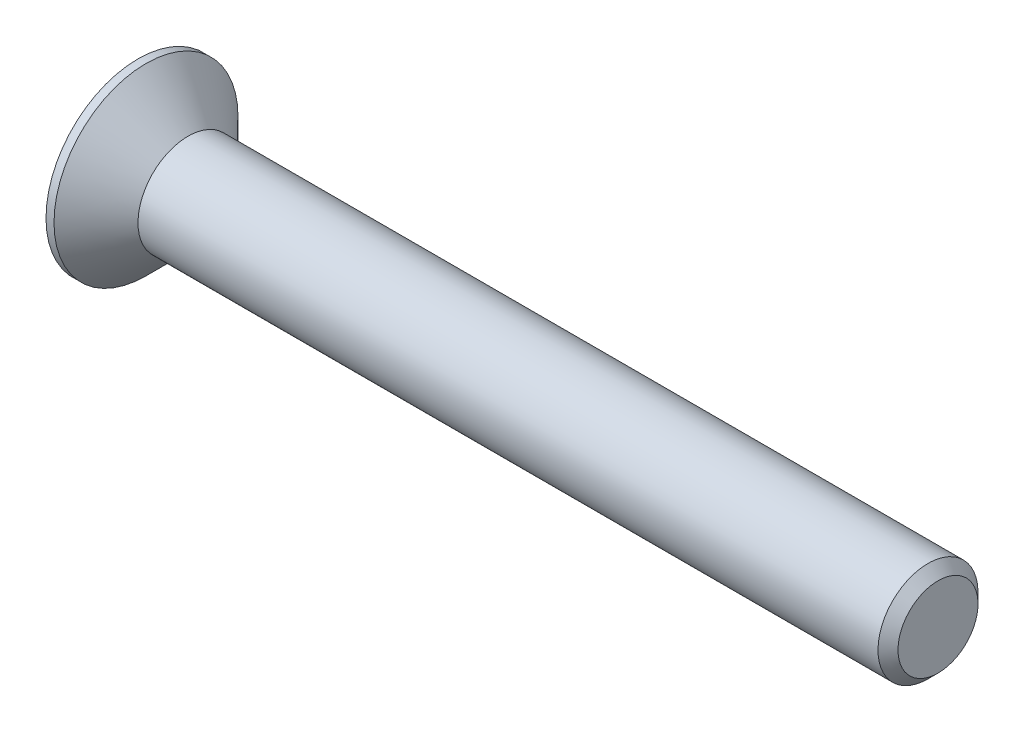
from build123d import *

# Parameters (mm, degrees)
CHAMFER1_SIZE      = 0.5
CUT_EXTRUDE1_DEPTH = 2.1


with BuildPart() as part:
    # Sketch1 → Revolve1 (revolve)
    with BuildSketch(Plane.XY, mode=Mode.PRIVATE) as revolve1_sk:
        Polygon((-2.5, 4.6), (-2.5, 0), (37.5, 0), (37.5, 2.5), (0, 2.5), (-2.1, 4.6), align=None)
    revolve(revolve1_sk.sketch.rotate(Axis((-2.5, 0, 0), (1, 0, 0)), 180), axis=Axis((-2.5, 0, 0), (1, 0, 0)))

    # Chamfer1
    chamfer1_edges = [part.edges().sort_by_distance(p)[0] for p in [
        (37.5, 2.5, 0),
    ]]
    chamfer(chamfer1_edges, length=CHAMFER1_SIZE)

    # Sketch2 → Cut-Extrude1 (cut)
    with BuildSketch(Plane.ZY.offset(2.5)):
        Polygon((-0.575, 2.3), (0.575, 2.3), (0.575, 0.575), (2.3, 0.575), (2.3, -0.575), (0.575, -0.575), (0.575, -2.3), (-0.575, -2.3), (-0.575, -0.575), (-2.3, -0.575), (-2.3, 0.575), (-0.575, 0.575), align=None)
    extrude(amount=-CUT_EXTRUDE1_DEPTH, mode=Mode.SUBTRACT)


solid = part.part
